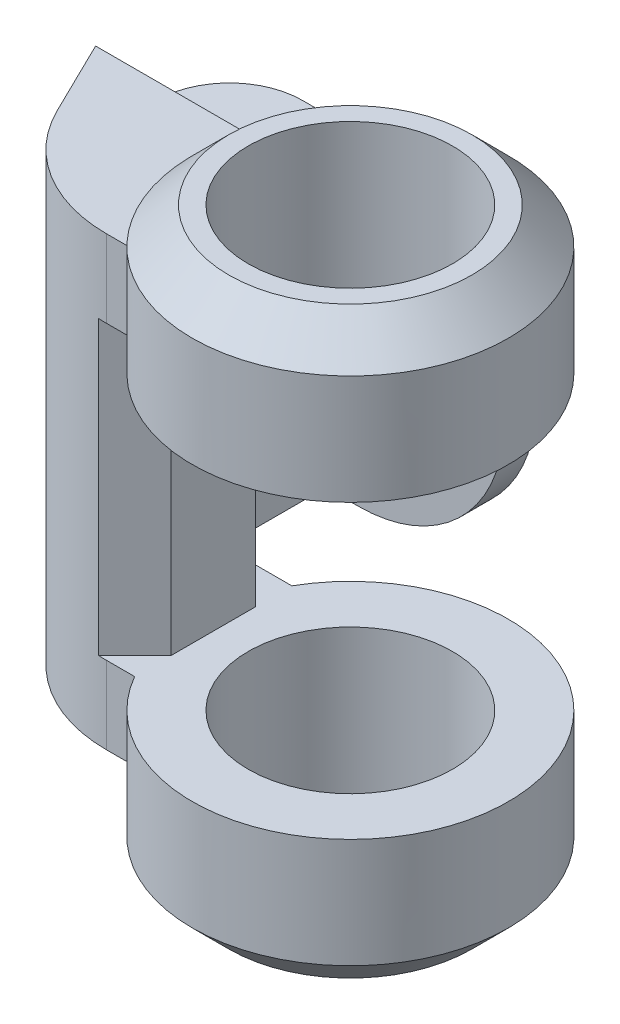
ISO-10303-21;
HEADER;
FILE_DESCRIPTION(('STEP AP214'),'2;1');
FILE_NAME('part.step','',(''),(''),'','','');
FILE_SCHEMA(('AUTOMOTIVE_DESIGN { 1 0 10303 214 1 1 1 1 }'));
ENDSEC;
DATA;
#1=APPLICATION_CONTEXT('core data for automotive mechanical design processes');
#2=APPLICATION_PROTOCOL_DEFINITION('international standard','automotive_design',2000,#1);
#3=PRODUCT_CONTEXT('',#1,'mechanical');
#4=PRODUCT('Part','Part','',(#3));
#5=PRODUCT_RELATED_PRODUCT_CATEGORY('part','',(#4));
#6=PRODUCT_DEFINITION_FORMATION('','',#4);
#7=PRODUCT_DEFINITION_CONTEXT('part definition',#1,'design');
#8=PRODUCT_DEFINITION('design','',#6,#7);
#9=PRODUCT_DEFINITION_SHAPE('','',#8);
#10=(LENGTH_UNIT() NAMED_UNIT(*) SI_UNIT(.MILLI.,.METRE.));
#11=(NAMED_UNIT(*) PLANE_ANGLE_UNIT() SI_UNIT($,.RADIAN.));
#12=(NAMED_UNIT(*) SI_UNIT($,.STERADIAN.) SOLID_ANGLE_UNIT());
#13=UNCERTAINTY_MEASURE_WITH_UNIT(LENGTH_MEASURE(1.E-05),#10,'distance_accuracy_value','');
#14=(GEOMETRIC_REPRESENTATION_CONTEXT(3) GLOBAL_UNCERTAINTY_ASSIGNED_CONTEXT((#13)) GLOBAL_UNIT_ASSIGNED_CONTEXT((#10,
#11,#12)) REPRESENTATION_CONTEXT('',''));
#15=CARTESIAN_POINT('',(0.,0.,0.));
#16=DIRECTION('',(0.,0.,1.));
#17=DIRECTION('',(1.,0.,0.));
#18=AXIS2_PLACEMENT_3D('',#15,#16,#17);
#19=CARTESIAN_POINT('',(-14.0652606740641,10.,-12.3851068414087));
#20=DIRECTION('',(0.,1.,0.));
#21=DIRECTION('',(0.,0.,1.));
#22=AXIS2_PLACEMENT_3D('',#19,#20,#21);
#23=PLANE('',#22);
#24=DIRECTION('',(0.,0.,1.));
#25=VECTOR('',#24,1.);
#26=CARTESIAN_POINT('',(-22.8442172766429,10.,-12.3851068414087));
#27=LINE('',#26,#25);
#28=CARTESIAN_POINT('',(-22.8442172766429,10.,-9.55869795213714));
#29=VERTEX_POINT('',#28);
#30=CARTESIAN_POINT('',(-22.8442172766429,10.,-5.38510684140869));
#31=VERTEX_POINT('',#30);
#32=EDGE_CURVE('E232',#29,#31,#27,.T.);
#33=ORIENTED_EDGE('',*,*,#32,.F.);
#34=CARTESIAN_POINT('',(-17.8442172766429,10.,-9.55869795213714));
#35=DIRECTION('',(0.,1.,0.));
#36=DIRECTION('',(0.,0.,1.));
#37=AXIS2_PLACEMENT_3D('',#34,#35,#36);
#38=CIRCLE('',#37,5.);
#39=CARTESIAN_POINT('',(-17.8442172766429,10.,-14.5586979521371));
#40=VERTEX_POINT('',#39);
#41=EDGE_CURVE('E11',#29,#40,#38,.F.);
#42=ORIENTED_EDGE('',*,*,#41,.T.);
#43=DIRECTION('',(-1.,0.,0.));
#44=VECTOR('',#43,1.);
#45=CARTESIAN_POINT('',(-22.8442172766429,10.,-14.5586979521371));
#46=LINE('',#45,#44);
#47=CARTESIAN_POINT('',(-11.8492132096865,10.,-14.5586979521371));
#48=VERTEX_POINT('',#47);
#49=EDGE_CURVE('E214',#48,#40,#46,.T.);
#50=ORIENTED_EDGE('',*,*,#49,.F.);
#51=DIRECTION('',(0.,0.,-1.));
#52=VECTOR('',#51,1.);
#53=CARTESIAN_POINT('',(-11.8492132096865,10.,-10.5586979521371));
#54=LINE('',#53,#52);
#55=CARTESIAN_POINT('',(-11.8492132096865,10.,-12.3851068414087));
#56=VERTEX_POINT('',#55);
#57=EDGE_CURVE('E191',#56,#48,#54,.T.);
#58=ORIENTED_EDGE('',*,*,#57,.F.);
#59=DIRECTION('',(1.,0.,0.));
#60=VECTOR('',#59,1.);
#61=CARTESIAN_POINT('',(-14.0652606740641,10.,-12.3851068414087));
#62=LINE('',#61,#60);
#63=CARTESIAN_POINT('',(-14.0652606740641,10.,-12.3851068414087));
#64=VERTEX_POINT('',#63);
#65=EDGE_CURVE('E211',#64,#56,#62,.T.);
#66=ORIENTED_EDGE('',*,*,#65,.F.);
#67=DIRECTION('',(0.,0.,1.));
#68=VECTOR('',#67,1.);
#69=CARTESIAN_POINT('',(-14.0652606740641,10.,-12.3851068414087));
#70=LINE('',#69,#68);
#71=CARTESIAN_POINT('',(-14.0652606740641,10.,-5.38510684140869));
#72=VERTEX_POINT('',#71);
#73=EDGE_CURVE('E244',#64,#72,#70,.T.);
#74=ORIENTED_EDGE('',*,*,#73,.T.);
#75=DIRECTION('',(-1.,0.,0.));
#76=VECTOR('',#75,1.);
#77=CARTESIAN_POINT('',(-14.0652606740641,10.,-5.38510684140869));
#78=LINE('',#77,#76);
#79=EDGE_CURVE('E233',#72,#31,#78,.T.);
#80=ORIENTED_EDGE('',*,*,#79,.T.);
#81=EDGE_LOOP('',(#33,#42,#50,#58,#66,#74,#80));
#82=FACE_BOUND('',#81,.T.);
#83=ADVANCED_FACE('F39',(#82),#23,.F.);
#84=CARTESIAN_POINT('',(-22.8442172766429,10.,-14.5586979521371));
#85=DIRECTION('',(0.,0.,-1.));
#86=DIRECTION('',(-1.,0.,0.));
#87=AXIS2_PLACEMENT_3D('',#84,#85,#86);
#88=PLANE('',#87);
#89=ORIENTED_EDGE('',*,*,#49,.T.);
#90=DIRECTION('',(0.,1.,0.));
#91=VECTOR('',#90,1.);
#92=CARTESIAN_POINT('',(-17.8442172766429,30.,-14.5586979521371));
#93=LINE('',#92,#91);
#94=CARTESIAN_POINT('',(-17.8442172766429,15.010017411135,-14.5586979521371));
#95=VERTEX_POINT('',#94);
#96=EDGE_CURVE('E356',#40,#95,#93,.T.);
#97=ORIENTED_EDGE('',*,*,#96,.T.);
#98=CARTESIAN_POINT('',(-11.8492132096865,20.,-14.5586979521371));
#99=DIRECTION('',(0.,0.,-1.));
#100=DIRECTION('',(-1.,0.,0.));
#101=AXIS2_PLACEMENT_3D('',#98,#99,#100);
#102=CIRCLE('',#101,7.8);
#103=CARTESIAN_POINT('',(-17.8442172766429,24.989982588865,-14.5586979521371));
#104=VERTEX_POINT('',#103);
#105=EDGE_CURVE('E407',#104,#95,#102,.T.);
#106=ORIENTED_EDGE('',*,*,#105,.F.);
#107=DIRECTION('',(0.,1.,0.));
#108=VECTOR('',#107,1.);
#109=CARTESIAN_POINT('',(-17.8442172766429,30.,-14.5586979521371));
#110=LINE('',#109,#108);
#111=CARTESIAN_POINT('',(-17.8442172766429,30.,-14.5586979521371));
#112=VERTEX_POINT('',#111);
#113=EDGE_CURVE('E210',#104,#112,#110,.T.);
#114=ORIENTED_EDGE('',*,*,#113,.T.);
#115=DIRECTION('',(-1.,0.,0.));
#116=VECTOR('',#115,1.);
#117=CARTESIAN_POINT('',(-22.8442172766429,30.,-14.5586979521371));
#118=LINE('',#117,#116);
#119=CARTESIAN_POINT('',(-11.8492132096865,30.,-14.5586979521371));
#120=VERTEX_POINT('',#119);
#121=EDGE_CURVE('E202',#120,#112,#118,.T.);
#122=ORIENTED_EDGE('',*,*,#121,.F.);
#123=CARTESIAN_POINT('',(-11.8492132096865,20.,-14.5586979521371));
#124=DIRECTION('',(0.,0.,-1.));
#125=DIRECTION('',(-1.,0.,0.));
#126=AXIS2_PLACEMENT_3D('',#123,#124,#125);
#127=CIRCLE('',#126,10.);
#128=EDGE_CURVE('E185',#120,#48,#127,.T.);
#129=ORIENTED_EDGE('',*,*,#128,.T.);
#130=EDGE_LOOP('',(#89,#97,#106,#114,#122,#129));
#131=FACE_BOUND('',#130,.T.);
#132=ADVANCED_FACE('F207',(#131),#88,.T.);
#133=CARTESIAN_POINT('',(-14.0652606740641,10.,-12.3851068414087));
#134=DIRECTION('',(0.,0.,1.));
#135=DIRECTION('',(1.,0.,0.));
#136=AXIS2_PLACEMENT_3D('',#133,#134,#135);
#137=PLANE('',#136);
#138=ORIENTED_EDGE('',*,*,#65,.T.);
#139=CARTESIAN_POINT('',(-11.8492132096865,20.,-12.3851068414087));
#140=DIRECTION('',(0.,0.,1.));
#141=DIRECTION('',(1.,0.,0.));
#142=AXIS2_PLACEMENT_3D('',#139,#140,#141);
#143=CIRCLE('',#142,10.);
#144=CARTESIAN_POINT('',(-11.8492132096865,30.,-12.3851068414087));
#145=VERTEX_POINT('',#144);
#146=EDGE_CURVE('E353',#56,#145,#143,.T.);
#147=ORIENTED_EDGE('',*,*,#146,.T.);
#148=DIRECTION('',(1.,0.,0.));
#149=VECTOR('',#148,1.);
#150=CARTESIAN_POINT('',(-14.0652606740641,30.,-12.3851068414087));
#151=LINE('',#150,#149);
#152=CARTESIAN_POINT('',(-14.0652606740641,30.,-12.3851068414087));
#153=VERTEX_POINT('',#152);
#154=EDGE_CURVE('E205',#153,#145,#151,.T.);
#155=ORIENTED_EDGE('',*,*,#154,.F.);
#156=DIRECTION('',(0.,-1.,0.));
#157=VECTOR('',#156,1.);
#158=CARTESIAN_POINT('',(-14.0652606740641,10.,-12.3851068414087));
#159=LINE('',#158,#157);
#160=EDGE_CURVE('E229',#153,#64,#159,.T.);
#161=ORIENTED_EDGE('',*,*,#160,.T.);
#162=EDGE_LOOP('',(#138,#147,#155,#161));
#163=FACE_BOUND('',#162,.T.);
#164=ADVANCED_FACE('F430',(#163),#137,.T.);
#165=CARTESIAN_POINT('',(-40.,0.,5.38510684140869));
#166=DIRECTION('',(0.,0.,-1.));
#167=DIRECTION('',(-1.,0.,0.));
#168=AXIS2_PLACEMENT_3D('',#165,#166,#167);
#169=PLANE('',#168);
#170=DIRECTION('',(1.,0.,0.));
#171=VECTOR('',#170,1.);
#172=CARTESIAN_POINT('',(-40.,35.3135169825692,5.38510684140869));
#173=LINE('',#172,#171);
#174=CARTESIAN_POINT('',(-11.3354246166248,35.3135169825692,5.38510684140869));
#175=VERTEX_POINT('',#174);
#176=CARTESIAN_POINT('',(-9.39734567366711,35.3135169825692,5.38510684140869));
#177=VERTEX_POINT('',#176);
#178=EDGE_CURVE('E267',#175,#177,#173,.T.);
#179=ORIENTED_EDGE('',*,*,#178,.F.);
#180=DIRECTION('',(0.,1.,0.));
#181=VECTOR('',#180,1.);
#182=CARTESIAN_POINT('',(-11.3354246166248,0.,5.38510684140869));
#183=LINE('',#182,#181);
#184=CARTESIAN_POINT('',(-11.3354246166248,30.,5.38510684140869));
#185=VERTEX_POINT('',#184);
#186=EDGE_CURVE('E343',#175,#185,#183,.F.);
#187=ORIENTED_EDGE('',*,*,#186,.T.);
#188=DIRECTION('',(1.,0.,0.));
#189=VECTOR('',#188,1.);
#190=CARTESIAN_POINT('',(-40.,30.,5.38510684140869));
#191=LINE('',#190,#189);
#192=CARTESIAN_POINT('',(-9.39734567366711,30.,5.38510684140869));
#193=VERTEX_POINT('',#192);
#194=EDGE_CURVE('E310',#185,#193,#191,.T.);
#195=ORIENTED_EDGE('',*,*,#194,.T.);
#196=DIRECTION('',(0.,-1.,0.));
#197=VECTOR('',#196,1.);
#198=CARTESIAN_POINT('',(-9.39734567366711,40.,5.38510684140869));
#199=LINE('',#198,#197);
#200=EDGE_CURVE('E278',#193,#177,#199,.F.);
#201=ORIENTED_EDGE('',*,*,#200,.T.);
#202=EDGE_LOOP('',(#179,#187,#195,#201));
#203=FACE_BOUND('',#202,.T.);
#204=ADVANCED_FACE('F478',(#203),#169,.F.);
#205=CARTESIAN_POINT('',(-40.,0.,-5.38510684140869));
#206=DIRECTION('',(0.,0.,-1.));
#207=DIRECTION('',(-1.,0.,0.));
#208=AXIS2_PLACEMENT_3D('',#205,#206,#207);
#209=PLANE('',#208);
#210=DIRECTION('',(0.,1.,0.));
#211=VECTOR('',#210,1.);
#212=CARTESIAN_POINT('',(-22.8442172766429,1.31351698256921,-5.38510684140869));
#213=LINE('',#212,#211);
#214=CARTESIAN_POINT('',(-22.8442172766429,30.,-5.38510684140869));
#215=VERTEX_POINT('',#214);
#216=CARTESIAN_POINT('',(-22.8442172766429,35.3135169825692,-5.38510684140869));
#217=VERTEX_POINT('',#216);
#218=EDGE_CURVE('E222',#215,#217,#213,.T.);
#219=ORIENTED_EDGE('',*,*,#218,.T.);
#220=DIRECTION('',(1.,0.,0.));
#221=VECTOR('',#220,1.);
#222=CARTESIAN_POINT('',(-40.,35.3135169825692,-5.38510684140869));
#223=LINE('',#222,#221);
#224=CARTESIAN_POINT('',(-9.39734567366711,35.3135169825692,-5.38510684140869));
#225=VERTEX_POINT('',#224);
#226=EDGE_CURVE('E265',#217,#225,#223,.T.);
#227=ORIENTED_EDGE('',*,*,#226,.T.);
#228=DIRECTION('',(0.,-1.,0.));
#229=VECTOR('',#228,1.);
#230=CARTESIAN_POINT('',(-9.39734567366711,40.,-5.38510684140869));
#231=LINE('',#230,#229);
#232=CARTESIAN_POINT('',(-9.39734567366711,30.,-5.38510684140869));
#233=VERTEX_POINT('',#232);
#234=EDGE_CURVE('E271',#233,#225,#231,.F.);
#235=ORIENTED_EDGE('',*,*,#234,.F.);
#236=DIRECTION('',(-1.,0.,0.));
#237=VECTOR('',#236,1.);
#238=CARTESIAN_POINT('',(0.,30.,-5.38510684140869));
#239=LINE('',#238,#237);
#240=CARTESIAN_POINT('',(-11.8973456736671,30.,-5.38510684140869));
#241=VERTEX_POINT('',#240);
#242=EDGE_CURVE('E307',#233,#241,#239,.T.);
#243=ORIENTED_EDGE('',*,*,#242,.T.);
#244=DIRECTION('',(0.,-1.,0.));
#245=VECTOR('',#244,1.);
#246=CARTESIAN_POINT('',(-11.8973456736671,0.,-5.38510684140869));
#247=LINE('',#246,#245);
#248=CARTESIAN_POINT('',(-11.8973456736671,10.,-5.38510684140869));
#249=VERTEX_POINT('',#248);
#250=EDGE_CURVE('E304',#241,#249,#247,.T.);
#251=ORIENTED_EDGE('',*,*,#250,.T.);
#252=DIRECTION('',(1.,0.,0.));
#253=VECTOR('',#252,1.);
#254=CARTESIAN_POINT('',(-40.,10.,-5.38510684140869));
#255=LINE('',#254,#253);
#256=CARTESIAN_POINT('',(-9.39734567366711,10.,-5.38510684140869));
#257=VERTEX_POINT('',#256);
#258=EDGE_CURVE('E301',#249,#257,#255,.T.);
#259=ORIENTED_EDGE('',*,*,#258,.T.);
#260=CARTESIAN_POINT('',(-9.39734567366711,4.6864830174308,-5.38510684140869));
#261=VERTEX_POINT('',#260);
#262=EDGE_CURVE('E272',#261,#257,#231,.F.);
#263=ORIENTED_EDGE('',*,*,#262,.F.);
#264=DIRECTION('',(1.,0.,0.));
#265=VECTOR('',#264,1.);
#266=CARTESIAN_POINT('',(-40.,4.6864830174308,-5.38510684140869));
#267=LINE('',#266,#265);
#268=CARTESIAN_POINT('',(-22.8442172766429,4.6864830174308,-5.38510684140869));
#269=VERTEX_POINT('',#268);
#270=EDGE_CURVE('E263',#269,#261,#267,.T.);
#271=ORIENTED_EDGE('',*,*,#270,.F.);
#272=EDGE_CURVE('E225',#269,#31,#213,.T.);
#273=ORIENTED_EDGE('',*,*,#272,.T.);
#274=ORIENTED_EDGE('',*,*,#79,.F.);
#275=DIRECTION('',(0.,-1.,0.));
#276=VECTOR('',#275,1.);
#277=CARTESIAN_POINT('',(-14.0652606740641,10.,-5.38510684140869));
#278=LINE('',#277,#276);
#279=CARTESIAN_POINT('',(-14.0652606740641,30.,-5.38510684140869));
#280=VERTEX_POINT('',#279);
#281=EDGE_CURVE('E238',#280,#72,#278,.T.);
#282=ORIENTED_EDGE('',*,*,#281,.F.);
#283=DIRECTION('',(1.,0.,0.));
#284=VECTOR('',#283,1.);
#285=CARTESIAN_POINT('',(-14.0652606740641,30.,-5.38510684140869));
#286=LINE('',#285,#284);
#287=EDGE_CURVE('E236',#215,#280,#286,.T.);
#288=ORIENTED_EDGE('',*,*,#287,.F.);
#289=EDGE_LOOP('',(#219,#227,#235,#243,#251,#259,#263,#271,#273,#274,#282,#288));
#290=FACE_BOUND('',#289,.T.);
#291=ADVANCED_FACE('F489',(#290),#209,.T.);
#292=CARTESIAN_POINT('',(0.,40.,0.));
#293=DIRECTION('',(0.,-1.,0.));
#294=DIRECTION('',(0.,0.,-1.));
#295=AXIS2_PLACEMENT_3D('',#292,#293,#294);
#296=CYLINDRICAL_SURFACE('',#295,10.8309501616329);
#297=CARTESIAN_POINT('',(0.,2.5,0.));
#298=DIRECTION('',(0.,1.,0.));
#299=DIRECTION('',(0.,0.,1.));
#300=AXIS2_PLACEMENT_3D('',#297,#298,#299);
#301=CIRCLE('',#300,10.8309501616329);
#302=CARTESIAN_POINT('',(0.,2.5,10.8309501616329));
#303=VERTEX_POINT('',#302);
#304=EDGE_CURVE('E324',#303,#303,#301,.T.);
#305=ORIENTED_EDGE('',*,*,#304,.T.);
#306=EDGE_LOOP('',(#305));
#307=FACE_BOUND('',#306,.T.);
#308=CARTESIAN_POINT('',(0.,10.,0.));
#309=DIRECTION('',(0.,1.,0.));
#310=DIRECTION('',(0.,0.,1.));
#311=AXIS2_PLACEMENT_3D('',#308,#309,#310);
#312=CIRCLE('',#311,10.8309501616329);
#313=CARTESIAN_POINT('',(-9.39734567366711,10.,5.38510684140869));
#314=VERTEX_POINT('',#313);
#315=EDGE_CURVE('E261',#314,#257,#312,.T.);
#316=ORIENTED_EDGE('',*,*,#315,.F.);
#317=CARTESIAN_POINT('',(-9.39734567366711,4.6864830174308,5.38510684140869));
#318=VERTEX_POINT('',#317);
#319=EDGE_CURVE('E279',#318,#314,#199,.F.);
#320=ORIENTED_EDGE('',*,*,#319,.F.);
#321=CARTESIAN_POINT('',(0.,4.6864830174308,0.));
#322=DIRECTION('',(0.,1.,0.));
#323=DIRECTION('',(0.,0.,1.));
#324=AXIS2_PLACEMENT_3D('',#321,#322,#323);
#325=CIRCLE('',#324,10.8309501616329);
#326=EDGE_CURVE('E282',#261,#318,#325,.T.);
#327=ORIENTED_EDGE('',*,*,#326,.F.);
#328=ORIENTED_EDGE('',*,*,#262,.T.);
#329=EDGE_LOOP('',(#316,#320,#327,#328));
#330=FACE_BOUND('',#329,.T.);
#331=ADVANCED_FACE('F484',(#307,#330),#296,.T.);
#332=CARTESIAN_POINT('',(0.,40.,0.));
#333=DIRECTION('',(0.,-1.,0.));
#334=DIRECTION('',(0.,0.,-1.));
#335=AXIS2_PLACEMENT_3D('',#332,#333,#334);
#336=CYLINDRICAL_SURFACE('',#335,7.);
#337=CARTESIAN_POINT('',(0.,0.,0.));
#338=DIRECTION('',(0.,1.,0.));
#339=DIRECTION('',(0.,0.,1.));
#340=AXIS2_PLACEMENT_3D('',#337,#338,#339);
#341=CIRCLE('',#340,7.);
#342=CARTESIAN_POINT('',(0.,0.,7.));
#343=VERTEX_POINT('',#342);
#344=EDGE_CURVE('E285',#343,#343,#341,.T.);
#345=ORIENTED_EDGE('',*,*,#344,.F.);
#346=EDGE_LOOP('',(#345));
#347=FACE_BOUND('',#346,.T.);
#348=CARTESIAN_POINT('',(0.,10.,0.));
#349=DIRECTION('',(0.,1.,0.));
#350=DIRECTION('',(0.,0.,1.));
#351=AXIS2_PLACEMENT_3D('',#348,#349,#350);
#352=CIRCLE('',#351,7.);
#353=CARTESIAN_POINT('',(0.,10.,7.));
#354=VERTEX_POINT('',#353);
#355=EDGE_CURVE('E260',#354,#354,#352,.T.);
#356=ORIENTED_EDGE('',*,*,#355,.T.);
#357=EDGE_LOOP('',(#356));
#358=FACE_BOUND('',#357,.T.);
#359=ADVANCED_FACE('F488',(#347,#358),#336,.F.);
#360=CARTESIAN_POINT('',(0.,37.5,0.));
#361=DIRECTION('',(0.,1.,0.));
#362=DIRECTION('',(0.,0.,1.));
#363=AXIS2_PLACEMENT_3D('',#360,#361,#362);
#364=CIRCLE('',#363,10.8309501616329);
#365=CARTESIAN_POINT('',(0.,37.5,10.8309501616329));
#366=VERTEX_POINT('',#365);
#367=EDGE_CURVE('E333',#366,#366,#364,.F.);
#368=ORIENTED_EDGE('',*,*,#367,.T.);
#369=EDGE_LOOP('',(#368));
#370=FACE_BOUND('',#369,.T.);
#371=ORIENTED_EDGE('',*,*,#200,.F.);
#372=CARTESIAN_POINT('',(0.,30.,0.));
#373=DIRECTION('',(0.,1.,0.));
#374=DIRECTION('',(0.,0.,1.));
#375=AXIS2_PLACEMENT_3D('',#372,#373,#374);
#376=CIRCLE('',#375,10.8309501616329);
#377=EDGE_CURVE('E258',#193,#233,#376,.T.);
#378=ORIENTED_EDGE('',*,*,#377,.T.);
#379=ORIENTED_EDGE('',*,*,#234,.T.);
#380=CARTESIAN_POINT('',(0.,35.3135169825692,0.));
#381=DIRECTION('',(0.,1.,0.));
#382=DIRECTION('',(0.,0.,1.));
#383=AXIS2_PLACEMENT_3D('',#380,#381,#382);
#384=CIRCLE('',#383,10.8309501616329);
#385=EDGE_CURVE('E275',#225,#177,#384,.T.);
#386=ORIENTED_EDGE('',*,*,#385,.T.);
#387=EDGE_LOOP('',(#371,#378,#379,#386));
#388=FACE_BOUND('',#387,.T.);
#389=ADVANCED_FACE('F492',(#370,#388),#296,.T.);
#390=CARTESIAN_POINT('',(0.,30.,0.));
#391=DIRECTION('',(0.,1.,0.));
#392=DIRECTION('',(0.,0.,1.));
#393=AXIS2_PLACEMENT_3D('',#390,#391,#392);
#394=CIRCLE('',#393,7.);
#395=CARTESIAN_POINT('',(0.,30.,7.));
#396=VERTEX_POINT('',#395);
#397=EDGE_CURVE('E255',#396,#396,#394,.T.);
#398=ORIENTED_EDGE('',*,*,#397,.F.);
#399=EDGE_LOOP('',(#398));
#400=FACE_BOUND('',#399,.T.);
#401=CARTESIAN_POINT('',(0.,40.,0.));
#402=DIRECTION('',(0.,1.,0.));
#403=DIRECTION('',(0.,0.,1.));
#404=AXIS2_PLACEMENT_3D('',#401,#402,#403);
#405=CIRCLE('',#404,7.);
#406=CARTESIAN_POINT('',(0.,40.,7.));
#407=VERTEX_POINT('',#406);
#408=EDGE_CURVE('E286',#407,#407,#405,.T.);
#409=ORIENTED_EDGE('',*,*,#408,.T.);
#410=EDGE_LOOP('',(#409));
#411=FACE_BOUND('',#410,.T.);
#412=ADVANCED_FACE('F499',(#400,#411),#336,.F.);
#413=CARTESIAN_POINT('',(0.,40.,0.));
#414=DIRECTION('',(0.,1.,0.));
#415=DIRECTION('',(0.,0.,1.));
#416=AXIS2_PLACEMENT_3D('',#413,#414,#415);
#417=PLANE('',#416);
#418=CARTESIAN_POINT('',(0.,40.,0.));
#419=DIRECTION('',(0.,1.,0.));
#420=DIRECTION('',(0.,0.,1.));
#421=AXIS2_PLACEMENT_3D('',#418,#419,#420);
#422=CIRCLE('',#421,8.33095016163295);
#423=CARTESIAN_POINT('',(0.,40.,8.33095016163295));
#424=VERTEX_POINT('',#423);
#425=EDGE_CURVE('E330',#424,#424,#422,.T.);
#426=ORIENTED_EDGE('',*,*,#425,.T.);
#427=EDGE_LOOP('',(#426));
#428=FACE_BOUND('',#427,.T.);
#429=ORIENTED_EDGE('',*,*,#408,.F.);
#430=EDGE_LOOP('',(#429));
#431=FACE_BOUND('',#430,.T.);
#432=ADVANCED_FACE('F699',(#428,#431),#417,.T.);
#433=CARTESIAN_POINT('',(0.,0.,0.));
#434=DIRECTION('',(0.,1.,0.));
#435=DIRECTION('',(0.,0.,1.));
#436=AXIS2_PLACEMENT_3D('',#433,#434,#435);
#437=PLANE('',#436);
#438=CARTESIAN_POINT('',(0.,0.,0.));
#439=DIRECTION('',(0.,1.,0.));
#440=DIRECTION('',(0.,0.,1.));
#441=AXIS2_PLACEMENT_3D('',#438,#439,#440);
#442=CIRCLE('',#441,8.33095016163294);
#443=CARTESIAN_POINT('',(0.,0.,8.33095016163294));
#444=VERTEX_POINT('',#443);
#445=EDGE_CURVE('E327',#444,#444,#442,.F.);
#446=ORIENTED_EDGE('',*,*,#445,.T.);
#447=EDGE_LOOP('',(#446));
#448=FACE_BOUND('',#447,.T.);
#449=ORIENTED_EDGE('',*,*,#344,.T.);
#450=EDGE_LOOP('',(#449));
#451=FACE_BOUND('',#450,.T.);
#452=ADVANCED_FACE('F704',(#448,#451),#437,.F.);
#453=DIRECTION('',(-1.,0.,0.));
#454=VECTOR('',#453,1.);
#455=CARTESIAN_POINT('',(0.,10.,5.38510684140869));
#456=LINE('',#455,#454);
#457=CARTESIAN_POINT('',(-11.3354246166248,10.,5.38510684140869));
#458=VERTEX_POINT('',#457);
#459=EDGE_CURVE('E312',#314,#458,#456,.T.);
#460=ORIENTED_EDGE('',*,*,#459,.T.);
#461=DIRECTION('',(0.,1.,0.));
#462=VECTOR('',#461,1.);
#463=CARTESIAN_POINT('',(-11.3354246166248,0.,5.38510684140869));
#464=LINE('',#463,#462);
#465=CARTESIAN_POINT('',(-11.3354246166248,4.6864830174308,5.38510684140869));
#466=VERTEX_POINT('',#465);
#467=EDGE_CURVE('E341',#458,#466,#464,.F.);
#468=ORIENTED_EDGE('',*,*,#467,.T.);
#469=DIRECTION('',(1.,0.,0.));
#470=VECTOR('',#469,1.);
#471=CARTESIAN_POINT('',(-40.,4.6864830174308,5.38510684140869));
#472=LINE('',#471,#470);
#473=EDGE_CURVE('E269',#466,#318,#472,.T.);
#474=ORIENTED_EDGE('',*,*,#473,.T.);
#475=ORIENTED_EDGE('',*,*,#319,.T.);
#476=EDGE_LOOP('',(#460,#468,#474,#475));
#477=FACE_BOUND('',#476,.T.);
#478=ADVANCED_FACE('F577',(#477),#169,.F.);
#479=CARTESIAN_POINT('',(-40.,4.6864830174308,0.));
#480=DIRECTION('',(0.,1.,0.));
#481=DIRECTION('',(0.,0.,1.));
#482=AXIS2_PLACEMENT_3D('',#479,#480,#481);
#483=PLANE('',#482);
#484=ORIENTED_EDGE('',*,*,#473,.F.);
#485=CARTESIAN_POINT('',(-11.3354246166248,4.6864830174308,-4.61489315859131));
#486=DIRECTION('',(0.,1.,0.));
#487=DIRECTION('',(0.,0.,1.));
#488=AXIS2_PLACEMENT_3D('',#485,#486,#487);
#489=CIRCLE('',#488,10.);
#490=CARTESIAN_POINT('',(-20.318478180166,4.6864830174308,-0.221176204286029));
#491=VERTEX_POINT('',#490);
#492=EDGE_CURVE('E351',#466,#491,#489,.F.);
#493=ORIENTED_EDGE('',*,*,#492,.T.);
#494=DIRECTION('',(-0.439371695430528,0.,-0.898305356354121));
#495=VECTOR('',#494,1.);
#496=CARTESIAN_POINT('',(-24.0306504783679,4.6864830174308,-7.8107963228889));
#497=LINE('',#496,#495);
#498=EDGE_CURVE('E226',#491,#269,#497,.T.);
#499=ORIENTED_EDGE('',*,*,#498,.T.);
#500=ORIENTED_EDGE('',*,*,#270,.T.);
#501=ORIENTED_EDGE('',*,*,#326,.T.);
#502=EDGE_LOOP('',(#484,#493,#499,#500,#501));
#503=FACE_BOUND('',#502,.T.);
#504=ADVANCED_FACE('F679',(#503),#483,.F.);
#505=CARTESIAN_POINT('',(-40.,35.3135169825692,0.));
#506=DIRECTION('',(0.,1.,0.));
#507=DIRECTION('',(0.,0.,1.));
#508=AXIS2_PLACEMENT_3D('',#505,#506,#507);
#509=PLANE('',#508);
#510=DIRECTION('',(-0.439371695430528,0.,-0.898305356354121));
#511=VECTOR('',#510,1.);
#512=CARTESIAN_POINT('',(-22.8442172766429,35.3135169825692,-5.38510684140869));
#513=LINE('',#512,#511);
#514=CARTESIAN_POINT('',(-20.318478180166,35.3135169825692,-0.221176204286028));
#515=VERTEX_POINT('',#514);
#516=EDGE_CURVE('E220',#515,#217,#513,.T.);
#517=ORIENTED_EDGE('',*,*,#516,.F.);
#518=CARTESIAN_POINT('',(-11.3354246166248,35.3135169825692,-4.61489315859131));
#519=DIRECTION('',(0.,1.,0.));
#520=DIRECTION('',(0.,0.,1.));
#521=AXIS2_PLACEMENT_3D('',#518,#519,#520);
#522=CIRCLE('',#521,10.);
#523=EDGE_CURVE('E339',#515,#175,#522,.T.);
#524=ORIENTED_EDGE('',*,*,#523,.T.);
#525=ORIENTED_EDGE('',*,*,#178,.T.);
#526=ORIENTED_EDGE('',*,*,#385,.F.);
#527=ORIENTED_EDGE('',*,*,#226,.F.);
#528=EDGE_LOOP('',(#517,#524,#525,#526,#527));
#529=FACE_BOUND('',#528,.T.);
#530=ADVANCED_FACE('F508',(#529),#509,.T.);
#531=CARTESIAN_POINT('',(0.,10.,-24.6148931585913));
#532=DIRECTION('',(0.,1.,0.));
#533=DIRECTION('',(0.,0.,1.));
#534=AXIS2_PLACEMENT_3D('',#531,#532,#533);
#535=PLANE('',#534);
#536=ORIENTED_EDGE('',*,*,#315,.T.);
#537=ORIENTED_EDGE('',*,*,#258,.F.);
#538=DIRECTION('',(-0.70710678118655,0.,-0.707106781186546));
#539=VECTOR('',#538,1.);
#540=CARTESIAN_POINT('',(-9.39734567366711,10.,-2.8851068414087));
#541=LINE('',#540,#539);
#542=CARTESIAN_POINT('',(-9.39734567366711,10.,-2.8851068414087));
#543=VERTEX_POINT('',#542);
#544=EDGE_CURVE('E317',#249,#543,#541,.F.);
#545=ORIENTED_EDGE('',*,*,#544,.T.);
#546=DIRECTION('',(0.,0.,1.));
#547=VECTOR('',#546,1.);
#548=CARTESIAN_POINT('',(-9.39734567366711,10.,-24.6148931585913));
#549=LINE('',#548,#547);
#550=CARTESIAN_POINT('',(-9.39734567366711,10.,2.8851068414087));
#551=VERTEX_POINT('',#550);
#552=EDGE_CURVE('E252',#543,#551,#549,.T.);
#553=ORIENTED_EDGE('',*,*,#552,.T.);
#554=DIRECTION('',(-0.70710678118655,0.,0.707106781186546));
#555=VECTOR('',#554,1.);
#556=CARTESIAN_POINT('',(-9.39734567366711,10.,2.8851068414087));
#557=LINE('',#556,#555);
#558=CARTESIAN_POINT('',(-11.882376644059,10.,5.3701378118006));
#559=VERTEX_POINT('',#558);
#560=EDGE_CURVE('E319',#551,#559,#557,.T.);
#561=ORIENTED_EDGE('',*,*,#560,.T.);
#562=CARTESIAN_POINT('',(-11.3354246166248,10.,-4.61489315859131));
#563=DIRECTION('',(0.,1.,0.));
#564=DIRECTION('',(0.,0.,1.));
#565=AXIS2_PLACEMENT_3D('',#562,#563,#564);
#566=CIRCLE('',#565,10.);
#567=EDGE_CURVE('E349',#559,#458,#566,.T.);
#568=ORIENTED_EDGE('',*,*,#567,.T.);
#569=ORIENTED_EDGE('',*,*,#459,.F.);
#570=EDGE_LOOP('',(#536,#537,#545,#553,#561,#568,#569));
#571=FACE_BOUND('',#570,.T.);
#572=ORIENTED_EDGE('',*,*,#355,.F.);
#573=EDGE_LOOP('',(#572));
#574=FACE_BOUND('',#573,.T.);
#575=ADVANCED_FACE('F504',(#571,#574),#535,.T.);
#576=CARTESIAN_POINT('',(0.,30.,-24.6148931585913));
#577=DIRECTION('',(0.,1.,0.));
#578=DIRECTION('',(0.,0.,1.));
#579=AXIS2_PLACEMENT_3D('',#576,#577,#578);
#580=PLANE('',#579);
#581=ORIENTED_EDGE('',*,*,#242,.F.);
#582=ORIENTED_EDGE('',*,*,#377,.F.);
#583=ORIENTED_EDGE('',*,*,#194,.F.);
#584=CARTESIAN_POINT('',(-11.3354246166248,30.,-4.61489315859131));
#585=DIRECTION('',(0.,1.,0.));
#586=DIRECTION('',(0.,0.,1.));
#587=AXIS2_PLACEMENT_3D('',#584,#585,#586);
#588=CIRCLE('',#587,10.);
#589=CARTESIAN_POINT('',(-11.882376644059,30.,5.37013781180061));
#590=VERTEX_POINT('',#589);
#591=EDGE_CURVE('E345',#185,#590,#588,.F.);
#592=ORIENTED_EDGE('',*,*,#591,.T.);
#593=DIRECTION('',(0.70710678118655,0.,-0.707106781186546));
#594=VECTOR('',#593,1.);
#595=CARTESIAN_POINT('',(9.05132716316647,30.,-15.5635659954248));
#596=LINE('',#595,#594);
#597=CARTESIAN_POINT('',(-9.39734567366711,30.,2.8851068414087));
#598=VERTEX_POINT('',#597);
#599=EDGE_CURVE('E322',#590,#598,#596,.T.);
#600=ORIENTED_EDGE('',*,*,#599,.T.);
#601=DIRECTION('',(0.,0.,1.));
#602=VECTOR('',#601,1.);
#603=CARTESIAN_POINT('',(-9.39734567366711,30.,-24.6148931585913));
#604=LINE('',#603,#602);
#605=CARTESIAN_POINT('',(-9.39734567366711,30.,-2.8851068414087));
#606=VERTEX_POINT('',#605);
#607=EDGE_CURVE('E251',#606,#598,#604,.T.);
#608=ORIENTED_EDGE('',*,*,#607,.F.);
#609=DIRECTION('',(0.70710678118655,0.,0.707106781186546));
#610=VECTOR('',#609,1.);
#611=CARTESIAN_POINT('',(-15.5635659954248,30.,-9.05132716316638));
#612=LINE('',#611,#610);
#613=EDGE_CURVE('E315',#606,#241,#612,.F.);
#614=ORIENTED_EDGE('',*,*,#613,.T.);
#615=EDGE_LOOP('',(#581,#582,#583,#592,#600,#608,#614));
#616=FACE_BOUND('',#615,.T.);
#617=ORIENTED_EDGE('',*,*,#397,.T.);
#618=EDGE_LOOP('',(#617));
#619=FACE_BOUND('',#618,.T.);
#620=ADVANCED_FACE('F507',(#616,#619),#580,.F.);
#621=CARTESIAN_POINT('',(-9.39734567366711,0.,-24.6148931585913));
#622=DIRECTION('',(1.,0.,0.));
#623=DIRECTION('',(0.,0.,-1.));
#624=AXIS2_PLACEMENT_3D('',#621,#622,#623);
#625=PLANE('',#624);
#626=ORIENTED_EDGE('',*,*,#552,.F.);
#627=DIRECTION('',(0.,1.,0.));
#628=VECTOR('',#627,1.);
#629=CARTESIAN_POINT('',(-9.39734567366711,0.,-2.8851068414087));
#630=LINE('',#629,#628);
#631=EDGE_CURVE('E298',#543,#606,#630,.T.);
#632=ORIENTED_EDGE('',*,*,#631,.T.);
#633=ORIENTED_EDGE('',*,*,#607,.T.);
#634=DIRECTION('',(0.,-1.,0.));
#635=VECTOR('',#634,1.);
#636=CARTESIAN_POINT('',(-9.39734567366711,10.,2.8851068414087));
#637=LINE('',#636,#635);
#638=EDGE_CURVE('E289',#598,#551,#637,.T.);
#639=ORIENTED_EDGE('',*,*,#638,.T.);
#640=EDGE_LOOP('',(#626,#632,#633,#639));
#641=FACE_BOUND('',#640,.T.);
#642=ADVANCED_FACE('F515',(#641),#625,.T.);
#643=CARTESIAN_POINT('',(-9.39734567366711,0.,-2.8851068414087));
#644=DIRECTION('',(-0.707106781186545,0.,0.707106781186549));
#645=DIRECTION('',(0.,1.,0.));
#646=AXIS2_PLACEMENT_3D('',#643,#644,#645);
#647=PLANE('',#646);
#648=ORIENTED_EDGE('',*,*,#544,.F.);
#649=ORIENTED_EDGE('',*,*,#250,.F.);
#650=ORIENTED_EDGE('',*,*,#613,.F.);
#651=ORIENTED_EDGE('',*,*,#631,.F.);
#652=EDGE_LOOP('',(#648,#649,#650,#651));
#653=FACE_BOUND('',#652,.T.);
#654=ADVANCED_FACE('F527',(#653),#647,.F.);
#655=CARTESIAN_POINT('',(-9.39734567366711,0.,2.8851068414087));
#656=DIRECTION('',(0.707106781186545,0.,0.707106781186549));
#657=DIRECTION('',(0.,1.,0.));
#658=AXIS2_PLACEMENT_3D('',#655,#656,#657);
#659=PLANE('',#658);
#660=ORIENTED_EDGE('',*,*,#599,.F.);
#661=DIRECTION('',(0.,1.,0.));
#662=VECTOR('',#661,1.);
#663=CARTESIAN_POINT('',(-11.882376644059,30.,5.37013781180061));
#664=LINE('',#663,#662);
#665=EDGE_CURVE('E347',#590,#559,#664,.F.);
#666=ORIENTED_EDGE('',*,*,#665,.T.);
#667=ORIENTED_EDGE('',*,*,#560,.F.);
#668=ORIENTED_EDGE('',*,*,#638,.F.);
#669=EDGE_LOOP('',(#660,#666,#667,#668));
#670=FACE_BOUND('',#669,.T.);
#671=ADVANCED_FACE('F535',(#670),#659,.T.);
#672=CARTESIAN_POINT('',(0.,2.5,0.));
#673=DIRECTION('',(0.,1.,0.));
#674=DIRECTION('',(0.,0.,1.));
#675=AXIS2_PLACEMENT_3D('',#672,#673,#674);
#676=CONICAL_SURFACE('',#675,10.8309501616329,0.78539816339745);
#677=ORIENTED_EDGE('',*,*,#445,.F.);
#678=EDGE_LOOP('',(#677));
#679=FACE_BOUND('',#678,.T.);
#680=ORIENTED_EDGE('',*,*,#304,.F.);
#681=EDGE_LOOP('',(#680));
#682=FACE_BOUND('',#681,.T.);
#683=ADVANCED_FACE('F446',(#679,#682),#676,.T.);
#684=CARTESIAN_POINT('',(0.,40.,0.));
#685=DIRECTION('',(0.,-1.,0.));
#686=DIRECTION('',(0.,0.,-1.));
#687=AXIS2_PLACEMENT_3D('',#684,#685,#686);
#688=CONICAL_SURFACE('',#687,8.33095016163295,0.785398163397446);
#689=ORIENTED_EDGE('',*,*,#367,.F.);
#690=EDGE_LOOP('',(#689));
#691=FACE_BOUND('',#690,.T.);
#692=ORIENTED_EDGE('',*,*,#425,.F.);
#693=EDGE_LOOP('',(#692));
#694=FACE_BOUND('',#693,.T.);
#695=ADVANCED_FACE('F441',(#691,#694),#688,.T.);
#696=CARTESIAN_POINT('',(-22.8442172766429,10.,-12.3851068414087));
#697=DIRECTION('',(1.,0.,0.));
#698=DIRECTION('',(0.,0.,-1.));
#699=AXIS2_PLACEMENT_3D('',#696,#697,#698);
#700=PLANE('',#699);
#701=DIRECTION('',(0.,0.,1.));
#702=VECTOR('',#701,1.);
#703=CARTESIAN_POINT('',(-22.8442172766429,30.,-12.3851068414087));
#704=LINE('',#703,#702);
#705=CARTESIAN_POINT('',(-22.8442172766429,30.,-9.55869795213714));
#706=VERTEX_POINT('',#705);
#707=EDGE_CURVE('E249',#706,#215,#704,.T.);
#708=ORIENTED_EDGE('',*,*,#707,.F.);
#709=DIRECTION('',(0.,1.,0.));
#710=VECTOR('',#709,1.);
#711=CARTESIAN_POINT('',(-22.8442172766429,10.,-9.55869795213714));
#712=LINE('',#711,#710);
#713=CARTESIAN_POINT('',(-22.8442172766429,24.989982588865,-9.55869795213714));
#714=VERTEX_POINT('',#713);
#715=EDGE_CURVE('E52',#706,#714,#712,.F.);
#716=ORIENTED_EDGE('',*,*,#715,.T.);
#717=CARTESIAN_POINT('',(-22.8442172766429,12.3854409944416,-9.93020701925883));
#718=CARTESIAN_POINT('',(-22.8442172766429,14.3253995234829,-15.9725585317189));
#719=CARTESIAN_POINT('',(-16.6742583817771,13.8714651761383,-14.5586979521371));
#720=CARTESIAN_POINT('',(-22.8442172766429,12.4929818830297,-9.8956789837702));
#721=CARTESIAN_POINT('',(-22.8442172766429,14.3145300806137,-15.917046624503));
#722=CARTESIAN_POINT('',(-16.7163235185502,13.9045882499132,-14.5586979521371));
#723=CARTESIAN_POINT('',(-22.8442172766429,12.6013613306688,-9.86386414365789));
#724=CARTESIAN_POINT('',(-22.8442172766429,14.308696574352,-15.8594089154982));
#725=CARTESIAN_POINT('',(-16.7594831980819,13.9392643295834,-14.5586979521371));
#726=CARTESIAN_POINT('',(-22.8442172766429,12.819489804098,-9.805444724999));
#727=CARTESIAN_POINT('',(-22.8442172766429,14.3075372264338,-15.7415108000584));
#728=CARTESIAN_POINT('',(-16.8479226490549,14.0119960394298,-14.5586979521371));
#729=CARTESIAN_POINT('',(-22.8442172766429,12.9292384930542,-9.77883889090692));
#730=CARTESIAN_POINT('',(-22.8442172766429,14.3120930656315,-15.6813007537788));
#731=CARTESIAN_POINT('',(-16.8932019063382,14.0500508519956,-14.5586979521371));
#732=CARTESIAN_POINT('',(-22.8442172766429,13.258920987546,-9.70675790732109));
#733=CARTESIAN_POINT('',(-22.8442172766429,14.3413292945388,-15.4999845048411));
#734=CARTESIAN_POINT('',(-17.0316283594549,14.1692719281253,-14.5586979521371));
#735=CARTESIAN_POINT('',(-22.8442172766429,13.4805012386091,-9.66863814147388));
#736=CARTESIAN_POINT('',(-22.8442172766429,14.3810668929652,-15.3757317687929));
#737=CARTESIAN_POINT('',(-17.1278364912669,14.2558594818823,-14.5586979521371));
#738=CARTESIAN_POINT('',(-22.8442172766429,13.8143063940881,-9.62468377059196));
#739=CARTESIAN_POINT('',(-22.8442172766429,14.4718191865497,-15.1893883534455));
#740=CARTESIAN_POINT('',(-17.2773832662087,14.3982435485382,-14.5586979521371));
#741=CARTESIAN_POINT('',(-22.8442172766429,13.9257377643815,-9.61224049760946));
#742=CARTESIAN_POINT('',(-22.8442172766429,14.5067877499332,-15.1278654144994));
#743=CARTESIAN_POINT('',(-17.3280684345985,14.4477508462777,-14.5586979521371));
#744=CARTESIAN_POINT('',(-22.8442172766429,14.1489998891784,-9.59142582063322));
#745=CARTESIAN_POINT('',(-22.8442172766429,14.5864956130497,-15.0059146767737));
#746=CARTESIAN_POINT('',(-17.4310470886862,14.5512875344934,-14.5586979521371));
#747=CARTESIAN_POINT('',(-22.8442172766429,14.2608306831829,-9.58305483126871));
#748=CARTESIAN_POINT('',(-22.8442172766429,14.6311199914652,-14.9454842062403));
#749=CARTESIAN_POINT('',(-17.4833407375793,14.6053173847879,-14.5586979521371));
#750=CARTESIAN_POINT('',(-22.8442172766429,14.4848976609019,-9.5700570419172));
#751=CARTESIAN_POINT('',(-22.8442172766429,14.7298712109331,-14.8263214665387));
#752=CARTESIAN_POINT('',(-17.5894080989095,14.7183166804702,-14.5586979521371));
#753=CARTESIAN_POINT('',(-22.8442172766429,14.597134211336,-9.56543676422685));
#754=CARTESIAN_POINT('',(-22.8442172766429,14.7839046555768,-14.7675771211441));
#755=CARTESIAN_POINT('',(-17.6431842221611,14.7772945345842,-14.5586979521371));
#756=CARTESIAN_POINT('',(-22.8442172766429,14.8216465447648,-9.55961886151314));
#757=CARTESIAN_POINT('',(-22.8442172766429,14.900982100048,-14.6525093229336));
#758=CARTESIAN_POINT('',(-17.7518414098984,14.9004205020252,-14.5586979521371));
#759=CARTESIAN_POINT('',(-22.8442172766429,14.9339222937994,-9.55841985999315));
#760=CARTESIAN_POINT('',(-22.8442172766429,14.9639197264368,-14.5961611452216));
#761=CARTESIAN_POINT('',(-17.8067220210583,14.9645665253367,-14.5586979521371));
#762=CARTESIAN_POINT('',(-22.8442172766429,15.2827287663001,-9.55944953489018));
#763=CARTESIAN_POINT('',(-22.8442172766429,15.171578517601,-14.4266262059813));
#764=CARTESIAN_POINT('',(-17.978521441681,15.1724643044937,-14.5586979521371));
#765=CARTESIAN_POINT('',(-22.8442172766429,15.5192474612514,-9.56694069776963));
#766=CARTESIAN_POINT('',(-22.8442172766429,15.3317550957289,-14.3171575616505));
#767=CARTESIAN_POINT('',(-18.0968755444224,15.3257449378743,-14.5586979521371));
#768=CARTESIAN_POINT('',(-22.8442172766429,15.9917731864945,-9.59186245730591));
#769=CARTESIAN_POINT('',(-22.8442172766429,15.6863399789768,-14.1146272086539));
#770=CARTESIAN_POINT('',(-18.3335074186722,15.6599729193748,-14.5586979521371));
#771=CARTESIAN_POINT('',(-22.8442172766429,16.227779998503,-9.60929668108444));
#772=CARTESIAN_POINT('',(-22.8442172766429,15.8801567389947,-14.0211407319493));
#773=CARTESIAN_POINT('',(-18.4517851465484,15.8409303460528,-14.5586979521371));
#774=CARTESIAN_POINT('',(-22.8442172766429,16.6997568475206,-9.65014584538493));
#775=CARTESIAN_POINT('',(-22.8442172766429,16.297701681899,-13.852136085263));
#776=CARTESIAN_POINT('',(-18.6832467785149,16.2333121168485,-14.5586979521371));
#777=CARTESIAN_POINT('',(-22.8442172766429,16.9357257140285,-9.67357356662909));
#778=CARTESIAN_POINT('',(-22.8442172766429,16.5212349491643,-13.7761626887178));
#779=CARTESIAN_POINT('',(-18.7964191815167,16.4448011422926,-14.5586979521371));
#780=CARTESIAN_POINT('',(-22.8442172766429,17.4074704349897,-9.72207278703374));
#781=CARTESIAN_POINT('',(-22.8442172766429,16.9929905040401,-13.6428294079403));
#782=CARTESIAN_POINT('',(-19.0106226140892,16.8988505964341,-14.5586979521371));
#783=CARTESIAN_POINT('',(-22.8442172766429,17.6432462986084,-9.74714420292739));
#784=CARTESIAN_POINT('',(-22.8442172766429,17.2413568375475,-13.5849827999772));
#785=CARTESIAN_POINT('',(-19.1116542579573,17.1414094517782,-14.5586979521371));
#786=CARTESIAN_POINT('',(-22.8442172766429,18.1160733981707,-9.79459498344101));
#787=CARTESIAN_POINT('',(-22.8442172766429,17.7585592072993,-13.4871432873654));
#788=CARTESIAN_POINT('',(-19.2939870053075,17.6568762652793,-14.5586979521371));
#789=CARTESIAN_POINT('',(-22.8442172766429,18.3531258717,-9.81696276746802));
#790=CARTESIAN_POINT('',(-22.8442172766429,18.0281077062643,-13.4467959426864));
#791=CARTESIAN_POINT('',(-19.3752046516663,17.9299057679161,-14.5586979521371));
#792=CARTESIAN_POINT('',(-22.8442172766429,18.827791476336,-9.85471171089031));
#793=CARTESIAN_POINT('',(-22.8442172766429,18.5805745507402,-13.3832784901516));
#794=CARTESIAN_POINT('',(-19.5091211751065,18.499595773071,-14.5586979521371));
#795=CARTESIAN_POINT('',(-22.8442172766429,19.065404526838,-9.87009381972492));
#796=CARTESIAN_POINT('',(-22.8442172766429,18.8645800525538,-13.359792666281));
#797=CARTESIAN_POINT('',(-19.5618239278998,18.7962530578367,-14.5586979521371));
#798=CARTESIAN_POINT('',(-22.8442172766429,19.5405706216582,-9.89077665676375));
#799=CARTESIAN_POINT('',(-22.8442172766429,19.4381132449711,-13.329038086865));
#800=CARTESIAN_POINT('',(-19.632221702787,19.4021403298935,-14.5586979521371));
#801=CARTESIAN_POINT('',(-22.8442172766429,19.7781226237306,-9.8960997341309));
#802=CARTESIAN_POINT('',(-22.8442172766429,19.7290722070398,-13.3215704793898));
#803=CARTESIAN_POINT('',(-19.6499943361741,19.7113408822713,-14.5586979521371));
#804=CARTESIAN_POINT('',(-22.8442172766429,20.253217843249,-9.89561900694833));
#805=CARTESIAN_POINT('',(-22.8442172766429,20.3092358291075,-13.3222564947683));
#806=CARTESIAN_POINT('',(-19.6483787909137,20.3294355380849,-14.5586979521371));
#807=CARTESIAN_POINT('',(-22.8442172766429,20.4907610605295,-9.88981504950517));
#808=CARTESIAN_POINT('',(-22.8442172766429,20.6000235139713,-13.3304140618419));
#809=CARTESIAN_POINT('',(-19.6289901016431,20.6383296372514,-14.5586979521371));
#810=CARTESIAN_POINT('',(-22.8442172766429,20.9623755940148,-9.86842962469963));
#811=CARTESIAN_POINT('',(-22.8442172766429,21.1686380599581,-13.3623319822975));
#812=CARTESIAN_POINT('',(-19.5561141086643,21.2385883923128,-14.5586979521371));
#813=CARTESIAN_POINT('',(-22.8442172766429,21.1964529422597,-9.85297228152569));
#814=CARTESIAN_POINT('',(-22.8442172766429,21.4479911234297,-13.3860598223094));
#815=CARTESIAN_POINT('',(-19.5030595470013,21.5301248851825,-14.5586979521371));
#816=CARTESIAN_POINT('',(-22.8442172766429,21.6640594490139,-9.8153888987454));
#817=CARTESIAN_POINT('',(-22.8442172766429,21.9914610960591,-13.4496005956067));
#818=CARTESIAN_POINT('',(-19.3695030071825,22.0900398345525,-14.5586979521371));
#819=CARTESIAN_POINT('',(-22.8442172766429,21.8975885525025,-9.79326221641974));
#820=CARTESIAN_POINT('',(-22.8442172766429,22.2566057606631,-13.4897184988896));
#821=CARTESIAN_POINT('',(-19.2889983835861,22.3584160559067,-14.5586979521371));
#822=CARTESIAN_POINT('',(-22.8442172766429,22.3646218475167,-9.74631425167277));
#823=CARTESIAN_POINT('',(-22.8442172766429,22.7669355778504,-13.5868627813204));
#824=CARTESIAN_POINT('',(-19.1083268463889,22.866751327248,-14.5586979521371));
#825=CARTESIAN_POINT('',(-22.8442172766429,22.5981257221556,-9.72148999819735));
#826=CARTESIAN_POINT('',(-22.8442172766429,23.0126799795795,-13.644318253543));
#827=CARTESIAN_POINT('',(-19.0081381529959,23.1066784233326,-14.5586979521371));
#828=CARTESIAN_POINT('',(-22.8442172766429,23.0653414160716,-9.67347137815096));
#829=CARTESIAN_POINT('',(-22.8442172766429,23.4796772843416,-13.7765380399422));
#830=CARTESIAN_POINT('',(-18.795877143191,23.5560809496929,-14.5586979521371));
#831=CARTESIAN_POINT('',(-22.8442172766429,23.2990532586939,-9.6502772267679));
#832=CARTESIAN_POINT('',(-22.8442172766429,23.701065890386,-13.8517766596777));
#833=CARTESIAN_POINT('',(-18.6838032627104,23.7655523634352,-14.5586979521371));
#834=CARTESIAN_POINT('',(-22.8442172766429,23.7714422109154,-9.60933549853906));
#835=CARTESIAN_POINT('',(-22.8442172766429,24.1193454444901,-14.0207963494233));
#836=CARTESIAN_POINT('',(-18.4521937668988,24.1585700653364,-14.5586979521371));
#837=CARTESIAN_POINT('',(-22.8442172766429,24.010129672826,-9.59169915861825));
#838=CARTESIAN_POINT('',(-22.8442172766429,24.3153426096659,-14.1153691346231));
#839=CARTESIAN_POINT('',(-18.3325571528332,24.3415514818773,-14.5586979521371));
#840=CARTESIAN_POINT('',(-22.8442172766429,24.4879333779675,-9.56662606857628));
#841=CARTESIAN_POINT('',(-22.8442172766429,24.6734586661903,-14.3203638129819));
#842=CARTESIAN_POINT('',(-18.0932768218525,24.6791523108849,-14.5586979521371));
#843=CARTESIAN_POINT('',(-22.8442172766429,24.7270492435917,-9.55918272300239));
#844=CARTESIAN_POINT('',(-22.8442172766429,24.8349741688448,-14.4312198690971));
#845=CARTESIAN_POINT('',(-17.9736331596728,24.8337900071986,-14.5586979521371));
#846=CARTESIAN_POINT('',(-22.8442172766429,25.2066896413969,-9.55825676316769));
#847=CARTESIAN_POINT('',(-22.8442172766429,25.1209310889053,-14.6662544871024));
#848=CARTESIAN_POINT('',(-17.7375427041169,25.1187901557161,-14.5586979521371));
#849=CARTESIAN_POINT('',(-22.8442172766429,25.4472148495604,-9.5648492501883));
#850=CARTESIAN_POINT('',(-22.8442172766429,25.2442384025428,-14.7908043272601));
#851=CARTESIAN_POINT('',(-17.6211165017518,25.2490179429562,-14.5586979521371));
#852=CARTESIAN_POINT('',(-22.8442172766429,25.807446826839,-9.5879235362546));
#853=CARTESIAN_POINT('',(-22.8442172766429,25.3967976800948,-14.9822924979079));
#854=CARTESIAN_POINT('',(-17.4513271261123,25.4279902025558,-14.5586979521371));
#855=CARTESIAN_POINT('',(-22.8442172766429,25.9275834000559,-9.59783351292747));
#856=CARTESIAN_POINT('',(-22.8442172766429,25.442543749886,-15.0475863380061));
#857=CARTESIAN_POINT('',(-17.3954712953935,25.4849811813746,-14.5586979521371));
#858=CARTESIAN_POINT('',(-22.8442172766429,26.1674039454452,-9.62245480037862));
#859=CARTESIAN_POINT('',(-22.8442172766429,25.5229630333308,-15.1792520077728));
#860=CARTESIAN_POINT('',(-17.2856363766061,25.5938595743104,-14.5586979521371));
#861=CARTESIAN_POINT('',(-22.8442172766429,26.287087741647,-9.63716781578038));
#862=CARTESIAN_POINT('',(-22.8442172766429,25.557486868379,-15.2456237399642));
#863=CARTESIAN_POINT('',(-17.2316579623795,25.6457451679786,-14.5586979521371));
#864=CARTESIAN_POINT('',(-22.8442172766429,26.406420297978,-9.65447418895));
#865=CARTESIAN_POINT('',(-22.8442172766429,25.5860918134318,-15.3116410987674));
#866=CARTESIAN_POINT('',(-17.1787400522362,25.6952737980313,-14.5586979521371));
#867=(BOUNDED_SURFACE() B_SPLINE_SURFACE(3,2,((#717,#718,#719),(#720,#721,#722),(#723,#724,
#725),(#726,#727,#728),(#729,#730,#731),(#732,#733,#734),(#735,#736,#737),(#738,#739,#740),
(#741,#742,#743),(#744,#745,#746),(#747,#748,#749),(#750,#751,#752),(#753,#754,#755),(#756,#757,
#758),(#759,#760,#761),(#762,#763,#764),(#765,#766,#767),(#768,#769,#770),(#771,#772,#773),
(#774,#775,#776),(#777,#778,#779),(#780,#781,#782),(#783,#784,#785),(#786,#787,#788),(#789,#790,
#791),(#792,#793,#794),(#795,#796,#797),(#798,#799,#800),(#801,#802,#803),(#804,#805,#806),
(#807,#808,#809),(#810,#811,#812),(#813,#814,#815),(#816,#817,#818),(#819,#820,#821),(#822,#823,
#824),(#825,#826,#827),(#828,#829,#830),(#831,#832,#833),(#834,#835,#836),(#837,#838,#839),
(#840,#841,#842),(#843,#844,#845),(#846,#847,#848),(#849,#850,#851),(#852,#853,#854),(#855,#856,
#857),(#858,#859,#860),(#861,#862,#863),(#864,#865,#866)),.UNSPECIFIED.,.F.,.F.,
.F.) B_SPLINE_SURFACE_WITH_KNOTS((4,2,2,2,2,2,2,2,2,2,2,2,2,2,2,2,2,2,2,2,2,2,2,2,4),(3,3),(0.,
0.33875433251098,0.677426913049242,1.35098056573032,1.68730099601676,2.02365566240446,
2.36059398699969,2.69739673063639,3.40696988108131,4.1168020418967,4.82816067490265,
5.53948329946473,6.25375221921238,6.96792403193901,7.68050722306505,8.39310020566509,
9.09671407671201,9.8003957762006,10.5048605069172,11.2094180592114,11.9272930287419,
12.6447032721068,13.3659617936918,13.7275085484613,14.0891837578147),(0.,1.),
.UNSPECIFIED.) GEOMETRIC_REPRESENTATION_ITEM() RATIONAL_B_SPLINE_SURFACE(((1.,0.61887325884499,
1.),(1.,0.622271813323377,1.),(1.,0.625730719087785,1.),(1.,0.63275815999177,1.),(1.,
0.636326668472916,1.),(1.,0.647141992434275,1.),(1.,0.654536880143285,1.),(1.,0.665830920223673,
1.),(1.,0.669626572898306,1.),(1.,0.677272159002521,1.),(1.,0.681122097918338,1.),(1.,
0.688864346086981,1.),(1.,0.692756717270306,1.),(1.,0.700555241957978,1.),(1.,0.704461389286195,
1.),(1.,0.716587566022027,1.),(1.,0.724797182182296,1.),(1.,0.74094143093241,1.),(1.,
0.748875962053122,1.),(1.,0.764173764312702,1.),(1.,0.7715357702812,1.),(1.,0.785294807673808,
1.),(1.,0.791691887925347,1.),(1.,0.80312513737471,1.),(1.,0.808155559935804,1.),(1.,
0.816399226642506,1.),(1.,0.81961271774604,1.),(1.,0.823896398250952,1.),(1.,0.824971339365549,
1.),(1.,0.824873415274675,1.),(1.,0.823700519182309,1.),(1.,0.819264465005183,1.),(1.,
0.816027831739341,1.),(1.,0.807802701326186,1.),(1.,0.802814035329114,1.),(1.,0.791481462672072,
1.),(1.,0.785136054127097,1.),(1.,0.771500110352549,1.),(1.,0.764209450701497,1.),(1.,
0.748904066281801,1.),(1.,0.740878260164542,1.),(1.,0.724549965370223,1.),(1.,0.716247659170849,
1.),(1.,0.699573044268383,1.),(1.,0.691200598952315,1.),(1.,0.678769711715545,1.),(1.,
0.674642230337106,1.),(1.,0.666452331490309,1.),(1.,0.662389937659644,1.),(1.,0.658370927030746,1.))) REPRESENTATION_ITEM('') SURFACE());
#868=CARTESIAN_POINT('',(-22.8442172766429,26.406420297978,-9.65447418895));
#869=CARTESIAN_POINT('',(-22.8442172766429,26.287087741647,-9.63716781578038));
#870=CARTESIAN_POINT('',(-22.8442172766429,26.1674039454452,-9.62245480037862));
#871=CARTESIAN_POINT('',(-22.8442172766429,25.9275834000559,-9.59783351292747));
#872=CARTESIAN_POINT('',(-22.8442172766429,25.807446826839,-9.58792353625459));
#873=CARTESIAN_POINT('',(-22.8442172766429,25.4472148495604,-9.5648492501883));
#874=CARTESIAN_POINT('',(-22.8442172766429,25.2066896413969,-9.55825676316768));
#875=CARTESIAN_POINT('',(-22.8442172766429,24.7270492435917,-9.55918272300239));
#876=CARTESIAN_POINT('',(-22.8442172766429,24.4879333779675,-9.56662606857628));
#877=CARTESIAN_POINT('',(-22.8442172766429,24.010129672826,-9.59169915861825));
#878=CARTESIAN_POINT('',(-22.8442172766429,23.7714422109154,-9.60933549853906));
#879=CARTESIAN_POINT('',(-22.8442172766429,23.2990532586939,-9.6502772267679));
#880=CARTESIAN_POINT('',(-22.8442172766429,23.0653414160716,-9.67347137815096));
#881=CARTESIAN_POINT('',(-22.8442172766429,22.5981257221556,-9.72148999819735));
#882=CARTESIAN_POINT('',(-22.8442172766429,22.3646218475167,-9.74631425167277));
#883=CARTESIAN_POINT('',(-22.8442172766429,21.8975885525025,-9.79326221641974));
#884=CARTESIAN_POINT('',(-22.8442172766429,21.6640594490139,-9.8153888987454));
#885=CARTESIAN_POINT('',(-22.8442172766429,21.1964529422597,-9.85297228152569));
#886=CARTESIAN_POINT('',(-22.8442172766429,20.9623755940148,-9.86842962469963));
#887=CARTESIAN_POINT('',(-22.8442172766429,20.4907610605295,-9.88981504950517));
#888=CARTESIAN_POINT('',(-22.8442172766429,20.253217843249,-9.89561900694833));
#889=CARTESIAN_POINT('',(-22.8442172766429,19.7781226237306,-9.8960997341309));
#890=CARTESIAN_POINT('',(-22.8442172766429,19.5405706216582,-9.89077665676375));
#891=CARTESIAN_POINT('',(-22.8442172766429,19.065404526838,-9.87009381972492));
#892=CARTESIAN_POINT('',(-22.8442172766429,18.827791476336,-9.85471171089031));
#893=CARTESIAN_POINT('',(-22.8442172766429,18.3531258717,-9.81696276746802));
#894=CARTESIAN_POINT('',(-22.8442172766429,18.1160733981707,-9.79459498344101));
#895=CARTESIAN_POINT('',(-22.8442172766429,17.6432462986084,-9.74714420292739));
#896=CARTESIAN_POINT('',(-22.8442172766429,17.4074704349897,-9.72207278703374));
#897=CARTESIAN_POINT('',(-22.8442172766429,16.9357257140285,-9.67357356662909));
#898=CARTESIAN_POINT('',(-22.8442172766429,16.6997568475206,-9.65014584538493));
#899=CARTESIAN_POINT('',(-22.8442172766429,16.227779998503,-9.60929668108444));
#900=CARTESIAN_POINT('',(-22.8442172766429,15.9917731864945,-9.59186245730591));
#901=CARTESIAN_POINT('',(-22.8442172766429,15.5192474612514,-9.56694069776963));
#902=CARTESIAN_POINT('',(-22.8442172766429,15.2827287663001,-9.55944953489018));
#903=CARTESIAN_POINT('',(-22.8442172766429,14.9339222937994,-9.55841985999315));
#904=CARTESIAN_POINT('',(-22.8442172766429,14.8216465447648,-9.55961886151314));
#905=CARTESIAN_POINT('',(-22.8442172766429,14.597134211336,-9.56543676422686));
#906=CARTESIAN_POINT('',(-22.8442172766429,14.4848976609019,-9.5700570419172));
#907=CARTESIAN_POINT('',(-22.8442172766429,14.2608306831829,-9.58305483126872));
#908=CARTESIAN_POINT('',(-22.8442172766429,14.1489998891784,-9.59142582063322));
#909=CARTESIAN_POINT('',(-22.8442172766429,13.9257377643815,-9.61224049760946));
#910=CARTESIAN_POINT('',(-22.8442172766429,13.8143063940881,-9.62468377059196));
#911=CARTESIAN_POINT('',(-22.8442172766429,13.4805012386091,-9.66863814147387));
#912=CARTESIAN_POINT('',(-22.8442172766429,13.258920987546,-9.70675790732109));
#913=CARTESIAN_POINT('',(-22.8442172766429,12.9292384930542,-9.77883889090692));
#914=CARTESIAN_POINT('',(-22.8442172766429,12.819489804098,-9.805444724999));
#915=CARTESIAN_POINT('',(-22.8442172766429,12.6013613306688,-9.86386414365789));
#916=CARTESIAN_POINT('',(-22.8442172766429,12.4929818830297,-9.8956789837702));
#917=CARTESIAN_POINT('',(-22.8442172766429,12.3854409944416,-9.93020701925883));
#918=B_SPLINE_CURVE_WITH_KNOTS('',3,(#868,#869,#870,#871,#872,#873,#874,#875,#876,#877,#878,
#879,#880,#881,#882,#883,#884,#885,#886,#887,#888,#889,#890,#891,#892,#893,#894,#895,#896,#897,
#898,#899,#900,#901,#902,#903,#904,#905,#906,#907,#908,#909,#910,#911,#912,#913,#914,#915,#916,
#917),.UNSPECIFIED.,.F.,.F.,(4,2,2,2,2,2,2,2,2,2,2,2,2,2,2,2,2,2,2,2,2,2,2,2,4),(0.,
0.361675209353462,0.723221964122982,1.44448048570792,2.16189072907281,2.87976569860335,
3.58432325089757,4.28878798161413,4.99246968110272,5.69608355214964,6.40867653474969,
7.12125972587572,7.83543153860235,8.54970045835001,9.26102308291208,9.97238171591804,
10.6822138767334,11.3917870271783,11.728589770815,12.0655280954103,12.401882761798,
12.7382031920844,13.4117568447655,13.7504294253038,14.0891837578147),.UNSPECIFIED.);
#919=CARTESIAN_POINT('',(-22.8442172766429,15.010017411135,-9.55869795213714));
#920=VERTEX_POINT('',#919);
#921=EDGE_CURVE('E64',#714,#920,#918,.T.);
#922=ORIENTED_EDGE('',*,*,#921,.T.);
#923=DIRECTION('',(0.,1.,0.));
#924=VECTOR('',#923,1.);
#925=CARTESIAN_POINT('',(-22.8442172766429,10.,-9.55869795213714));
#926=LINE('',#925,#924);
#927=EDGE_CURVE('E361',#920,#29,#926,.F.);
#928=ORIENTED_EDGE('',*,*,#927,.T.);
#929=ORIENTED_EDGE('',*,*,#32,.T.);
#930=DIRECTION('',(0.,1.,0.));
#931=VECTOR('',#930,1.);
#932=CARTESIAN_POINT('',(-22.8442172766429,10.,-5.38510684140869));
#933=LINE('',#932,#931);
#934=EDGE_CURVE('E228',#31,#215,#933,.T.);
#935=ORIENTED_EDGE('',*,*,#934,.T.);
#936=EDGE_LOOP('',(#708,#716,#922,#928,#929,#935));
#937=FACE_BOUND('',#936,.T.);
#938=ADVANCED_FACE('F369',(#937),#700,.F.);
#939=CARTESIAN_POINT('',(-14.0652606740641,30.,-12.3851068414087));
#940=DIRECTION('',(0.,-1.,0.));
#941=DIRECTION('',(0.,0.,-1.));
#942=AXIS2_PLACEMENT_3D('',#939,#940,#941);
#943=PLANE('',#942);
#944=ORIENTED_EDGE('',*,*,#121,.T.);
#945=CARTESIAN_POINT('',(-17.8442172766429,30.,-9.55869795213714));
#946=DIRECTION('',(0.,-1.,0.));
#947=DIRECTION('',(0.,0.,-1.));
#948=AXIS2_PLACEMENT_3D('',#945,#946,#947);
#949=CIRCLE('',#948,5.);
#950=EDGE_CURVE('E359',#112,#706,#949,.F.);
#951=ORIENTED_EDGE('',*,*,#950,.T.);
#952=ORIENTED_EDGE('',*,*,#707,.T.);
#953=ORIENTED_EDGE('',*,*,#287,.T.);
#954=DIRECTION('',(0.,0.,1.));
#955=VECTOR('',#954,1.);
#956=CARTESIAN_POINT('',(-14.0652606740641,30.,-12.3851068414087));
#957=LINE('',#956,#955);
#958=EDGE_CURVE('E246',#153,#280,#957,.T.);
#959=ORIENTED_EDGE('',*,*,#958,.F.);
#960=ORIENTED_EDGE('',*,*,#154,.T.);
#961=DIRECTION('',(0.,0.,-1.));
#962=VECTOR('',#961,1.);
#963=CARTESIAN_POINT('',(-11.8492132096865,30.,-10.5586979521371));
#964=LINE('',#963,#962);
#965=EDGE_CURVE('E188',#145,#120,#964,.T.);
#966=ORIENTED_EDGE('',*,*,#965,.T.);
#967=EDGE_LOOP('',(#944,#951,#952,#953,#959,#960,#966));
#968=FACE_BOUND('',#967,.T.);
#969=ADVANCED_FACE('F201',(#968),#943,.F.);
#970=CARTESIAN_POINT('',(-14.0652606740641,10.,-12.3851068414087));
#971=DIRECTION('',(-1.,0.,0.));
#972=DIRECTION('',(0.,0.,1.));
#973=AXIS2_PLACEMENT_3D('',#970,#971,#972);
#974=PLANE('',#973);
#975=ORIENTED_EDGE('',*,*,#281,.T.);
#976=ORIENTED_EDGE('',*,*,#73,.F.);
#977=ORIENTED_EDGE('',*,*,#160,.F.);
#978=ORIENTED_EDGE('',*,*,#958,.T.);
#979=EDGE_LOOP('',(#975,#976,#977,#978));
#980=FACE_BOUND('',#979,.T.);
#981=ADVANCED_FACE('F434',(#980),#974,.F.);
#982=CARTESIAN_POINT('',(-22.8442172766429,1.31351698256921,-5.38510684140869));
#983=DIRECTION('',(0.898305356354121,0.,-0.439371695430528));
#984=DIRECTION('',(-0.439371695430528,0.,-0.898305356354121));
#985=AXIS2_PLACEMENT_3D('',#982,#983,#984);
#986=PLANE('',#985);
#987=ORIENTED_EDGE('',*,*,#498,.F.);
#988=DIRECTION('',(0.,1.,0.));
#989=VECTOR('',#988,1.);
#990=CARTESIAN_POINT('',(-20.318478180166,1.31351698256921,-0.221176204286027));
#991=LINE('',#990,#989);
#992=EDGE_CURVE('E336',#491,#515,#991,.T.);
#993=ORIENTED_EDGE('',*,*,#992,.T.);
#994=ORIENTED_EDGE('',*,*,#516,.T.);
#995=ORIENTED_EDGE('',*,*,#218,.F.);
#996=ORIENTED_EDGE('',*,*,#934,.F.);
#997=ORIENTED_EDGE('',*,*,#272,.F.);
#998=EDGE_LOOP('',(#987,#993,#994,#995,#996,#997));
#999=FACE_BOUND('',#998,.T.);
#1000=ADVANCED_FACE('F421',(#999),#986,.F.);
#1001=CARTESIAN_POINT('',(-11.3354246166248,1.31351698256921,-4.61489315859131));
#1002=DIRECTION('',(0.,1.,0.));
#1003=DIRECTION('',(0.,0.,1.));
#1004=AXIS2_PLACEMENT_3D('',#1001,#1002,#1003);
#1005=CYLINDRICAL_SURFACE('',#1004,10.);
#1006=ORIENTED_EDGE('',*,*,#591,.F.);
#1007=ORIENTED_EDGE('',*,*,#186,.F.);
#1008=ORIENTED_EDGE('',*,*,#523,.F.);
#1009=ORIENTED_EDGE('',*,*,#992,.F.);
#1010=ORIENTED_EDGE('',*,*,#492,.F.);
#1011=ORIENTED_EDGE('',*,*,#467,.F.);
#1012=ORIENTED_EDGE('',*,*,#567,.F.);
#1013=ORIENTED_EDGE('',*,*,#665,.F.);
#1014=EDGE_LOOP('',(#1006,#1007,#1008,#1009,#1010,#1011,#1012,#1013));
#1015=FACE_BOUND('',#1014,.T.);
#1016=ADVANCED_FACE('F377',(#1015),#1005,.T.);
#1017=CARTESIAN_POINT('',(-11.8492132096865,20.,-16.5586979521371));
#1018=DIRECTION('',(0.,0.,1.));
#1019=DIRECTION('',(1.,0.,0.));
#1020=AXIS2_PLACEMENT_3D('',#1017,#1018,#1019);
#1021=CYLINDRICAL_SURFACE('',#1020,7.8);
#1022=CARTESIAN_POINT('',(-11.8492132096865,20.,-16.5586979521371));
#1023=DIRECTION('',(0.,0.,-1.));
#1024=DIRECTION('',(-1.,0.,0.));
#1025=AXIS2_PLACEMENT_3D('',#1022,#1023,#1024);
#1026=CIRCLE('',#1025,7.8);
#1027=CARTESIAN_POINT('',(-19.6492132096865,20.,-16.5586979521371));
#1028=VERTEX_POINT('',#1027);
#1029=EDGE_CURVE('E216',#1028,#1028,#1026,.T.);
#1030=ORIENTED_EDGE('',*,*,#1029,.F.);
#1031=EDGE_LOOP('',(#1030));
#1032=FACE_BOUND('',#1031,.T.);
#1033=ORIENTED_EDGE('',*,*,#105,.T.);
#1034=EDGE_CURVE('E404',#95,#104,#102,.T.);
#1035=ORIENTED_EDGE('',*,*,#1034,.T.);
#1036=EDGE_LOOP('',(#1033,#1035));
#1037=FACE_BOUND('',#1036,.T.);
#1038=ADVANCED_FACE('F391',(#1032,#1037),#1021,.T.);
#1039=CARTESIAN_POINT('',(-11.8492132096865,20.,-16.5586979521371));
#1040=DIRECTION('',(0.,0.,-1.));
#1041=DIRECTION('',(-1.,0.,0.));
#1042=AXIS2_PLACEMENT_3D('',#1039,#1040,#1041);
#1043=PLANE('',#1042);
#1044=ORIENTED_EDGE('',*,*,#1029,.T.);
#1045=EDGE_LOOP('',(#1044));
#1046=FACE_BOUND('',#1045,.T.);
#1047=ADVANCED_FACE('F414',(#1046),#1043,.T.);
#1048=CARTESIAN_POINT('',(-11.8492132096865,20.,-10.5586979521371));
#1049=DIRECTION('',(0.,0.,-1.));
#1050=DIRECTION('',(-1.,0.,0.));
#1051=AXIS2_PLACEMENT_3D('',#1048,#1049,#1050);
#1052=CYLINDRICAL_SURFACE('',#1051,10.);
#1053=ORIENTED_EDGE('',*,*,#57,.T.);
#1054=ORIENTED_EDGE('',*,*,#128,.F.);
#1055=ORIENTED_EDGE('',*,*,#965,.F.);
#1056=ORIENTED_EDGE('',*,*,#146,.F.);
#1057=EDGE_LOOP('',(#1053,#1054,#1055,#1056));
#1058=FACE_BOUND('',#1057,.T.);
#1059=ADVANCED_FACE('F187',(#1058),#1052,.T.);
#1060=CARTESIAN_POINT('',(-17.8442172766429,10.,-9.55869795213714));
#1061=DIRECTION('',(0.,-1.,0.));
#1062=DIRECTION('',(0.,0.,-1.));
#1063=AXIS2_PLACEMENT_3D('',#1060,#1061,#1062);
#1064=CYLINDRICAL_SURFACE('',#1063,5.);
#1065=ORIENTED_EDGE('',*,*,#950,.F.);
#1066=ORIENTED_EDGE('',*,*,#113,.F.);
#1067=CARTESIAN_POINT('',(-17.8442172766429,24.989982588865,-9.55869795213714));
#1068=DIRECTION('',(0.,-1.,0.));
#1069=DIRECTION('',(0.,0.,-1.));
#1070=AXIS2_PLACEMENT_3D('',#1067,#1068,#1069);
#1071=CIRCLE('',#1070,5.);
#1072=EDGE_CURVE('E196',#714,#104,#1071,.T.);
#1073=ORIENTED_EDGE('',*,*,#1072,.F.);
#1074=ORIENTED_EDGE('',*,*,#715,.F.);
#1075=EDGE_LOOP('',(#1065,#1066,#1073,#1074));
#1076=FACE_BOUND('',#1075,.T.);
#1077=ADVANCED_FACE('F41',(#1076),#1064,.T.);
#1078=ORIENTED_EDGE('',*,*,#1072,.T.);
#1079=ORIENTED_EDGE('',*,*,#1034,.F.);
#1080=CARTESIAN_POINT('',(-17.8442172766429,15.010017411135,-9.55869795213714));
#1081=DIRECTION('',(0.,-1.,0.));
#1082=DIRECTION('',(0.,0.,-1.));
#1083=AXIS2_PLACEMENT_3D('',#1080,#1081,#1082);
#1084=CIRCLE('',#1083,5.);
#1085=EDGE_CURVE('E398',#920,#95,#1084,.T.);
#1086=ORIENTED_EDGE('',*,*,#1085,.F.);
#1087=ORIENTED_EDGE('',*,*,#921,.F.);
#1088=EDGE_LOOP('',(#1078,#1079,#1086,#1087));
#1089=FACE_BOUND('',#1088,.T.);
#1090=ADVANCED_FACE('F380',(#1089),#867,.T.);
#1091=CARTESIAN_POINT('',(-17.8442172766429,10.,-9.55869795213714));
#1092=DIRECTION('',(0.,-1.,0.));
#1093=DIRECTION('',(0.,0.,-1.));
#1094=AXIS2_PLACEMENT_3D('',#1091,#1092,#1093);
#1095=CYLINDRICAL_SURFACE('',#1094,5.);
#1096=ORIENTED_EDGE('',*,*,#41,.F.);
#1097=ORIENTED_EDGE('',*,*,#927,.F.);
#1098=ORIENTED_EDGE('',*,*,#1085,.T.);
#1099=ORIENTED_EDGE('',*,*,#96,.F.);
#1100=EDGE_LOOP('',(#1096,#1097,#1098,#1099));
#1101=FACE_BOUND('',#1100,.T.);
#1102=ADVANCED_FACE('F379',(#1101),#1095,.T.);
#1103=CLOSED_SHELL('',(#83,#132,#164,#204,#291,#331,#359,#389,#412,#432,#452,#478,#504,#530,
#575,#620,#642,#654,#671,#683,#695,#938,#969,#981,#1000,#1016,#1038,#1047,#1059,#1077,#1090,#1102));
#1104=MANIFOLD_SOLID_BREP('B2',#1103);
#1105=ADVANCED_BREP_SHAPE_REPRESENTATION('',(#18,#1104),#14);
#1106=SHAPE_DEFINITION_REPRESENTATION(#9,#1105);
ENDSEC;
END-ISO-10303-21;
